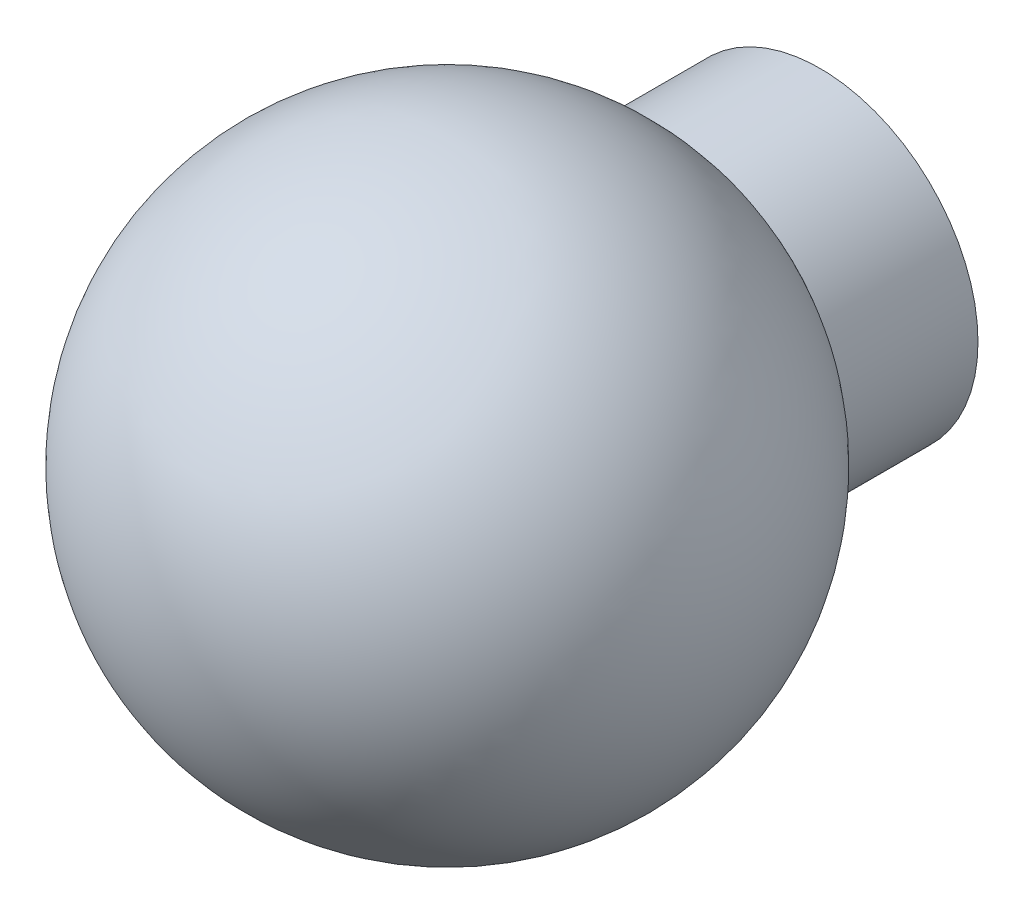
ISO-10303-21;
HEADER;
FILE_DESCRIPTION(('STEP AP214'),'2;1');
FILE_NAME('part.step','',(''),(''),'','','');
FILE_SCHEMA(('AUTOMOTIVE_DESIGN { 1 0 10303 214 1 1 1 1 }'));
ENDSEC;
DATA;
#1=APPLICATION_CONTEXT('core data for automotive mechanical design processes');
#2=APPLICATION_PROTOCOL_DEFINITION('international standard','automotive_design',2000,#1);
#3=PRODUCT_CONTEXT('',#1,'mechanical');
#4=PRODUCT('Part','Part','',(#3));
#5=PRODUCT_RELATED_PRODUCT_CATEGORY('part','',(#4));
#6=PRODUCT_DEFINITION_FORMATION('','',#4);
#7=PRODUCT_DEFINITION_CONTEXT('part definition',#1,'design');
#8=PRODUCT_DEFINITION('design','',#6,#7);
#9=PRODUCT_DEFINITION_SHAPE('','',#8);
#10=(LENGTH_UNIT() NAMED_UNIT(*) SI_UNIT(.MILLI.,.METRE.));
#11=(NAMED_UNIT(*) PLANE_ANGLE_UNIT() SI_UNIT($,.RADIAN.));
#12=(NAMED_UNIT(*) SI_UNIT($,.STERADIAN.) SOLID_ANGLE_UNIT());
#13=UNCERTAINTY_MEASURE_WITH_UNIT(LENGTH_MEASURE(1.E-05),#10,'distance_accuracy_value','');
#14=(GEOMETRIC_REPRESENTATION_CONTEXT(3) GLOBAL_UNCERTAINTY_ASSIGNED_CONTEXT((#13)) GLOBAL_UNIT_ASSIGNED_CONTEXT((#10,
#11,#12)) REPRESENTATION_CONTEXT('',''));
#15=CARTESIAN_POINT('',(0.,0.,0.));
#16=DIRECTION('',(0.,0.,1.));
#17=DIRECTION('',(1.,0.,0.));
#18=AXIS2_PLACEMENT_3D('',#15,#16,#17);
#19=CARTESIAN_POINT('',(0.,0.,0.));
#20=DIRECTION('',(0.,1.,0.));
#21=DIRECTION('',(-1.,0.,0.));
#22=AXIS2_PLACEMENT_3D('',#19,#20,#21);
#23=SPHERICAL_SURFACE('',#22,14.38);
#24=CARTESIAN_POINT('',(0.,0.,0.));
#25=DIRECTION('',(0.,0.,1.));
#26=DIRECTION('',(1.,0.,0.));
#27=AXIS2_PLACEMENT_3D('',#24,#25,#26);
#28=SPHERICAL_SURFACE('',#27,14.38);
#29=CARTESIAN_POINT('',(0.,0.,-11.9492426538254));
#30=DIRECTION('',(0.,0.,1.));
#31=DIRECTION('',(1.,0.,0.));
#32=AXIS2_PLACEMENT_3D('',#29,#30,#31);
#33=CIRCLE('',#32,8.);
#34=CARTESIAN_POINT('',(8.,0.,-11.9492426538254));
#35=VERTEX_POINT('',#34);
#36=EDGE_CURVE('E10',#35,#35,#33,.F.);
#37=ORIENTED_EDGE('',*,*,#36,.F.);
#38=EDGE_LOOP('',(#37));
#39=FACE_BOUND('',#38,.T.);
#40=ADVANCED_FACE('F24',(#39),#28,.T.);
#41=CARTESIAN_POINT('',(0.,0.,-18.88));
#42=DIRECTION('',(0.,0.,1.));
#43=DIRECTION('',(1.,0.,0.));
#44=AXIS2_PLACEMENT_3D('',#41,#42,#43);
#45=CYLINDRICAL_SURFACE('',#44,8.);
#46=ORIENTED_EDGE('',*,*,#36,.T.);
#47=EDGE_LOOP('',(#46));
#48=FACE_BOUND('',#47,.T.);
#49=CARTESIAN_POINT('',(0.,0.,-18.88));
#50=DIRECTION('',(0.,0.,1.));
#51=DIRECTION('',(1.,0.,0.));
#52=AXIS2_PLACEMENT_3D('',#49,#50,#51);
#53=CIRCLE('',#52,8.);
#54=CARTESIAN_POINT('',(8.,0.,-18.88));
#55=VERTEX_POINT('',#54);
#56=EDGE_CURVE('E30',#55,#55,#53,.T.);
#57=ORIENTED_EDGE('',*,*,#56,.T.);
#58=EDGE_LOOP('',(#57));
#59=FACE_BOUND('',#58,.T.);
#60=ADVANCED_FACE('F36',(#48,#59),#45,.T.);
#61=CARTESIAN_POINT('',(0.,0.,-18.88));
#62=DIRECTION('',(0.,0.,1.));
#63=DIRECTION('',(1.,0.,0.));
#64=AXIS2_PLACEMENT_3D('',#61,#62,#63);
#65=PLANE('',#64);
#66=ORIENTED_EDGE('',*,*,#56,.F.);
#67=EDGE_LOOP('',(#66));
#68=FACE_BOUND('',#67,.T.);
#69=ADVANCED_FACE('F38',(#68),#65,.F.);
#70=CLOSED_SHELL('',(#40,#60,#69));
#71=MANIFOLD_SOLID_BREP('B2',#70);
#72=ADVANCED_BREP_SHAPE_REPRESENTATION('',(#18,#71),#14);
#73=SHAPE_DEFINITION_REPRESENTATION(#9,#72);
ENDSEC;
END-ISO-10303-21;
